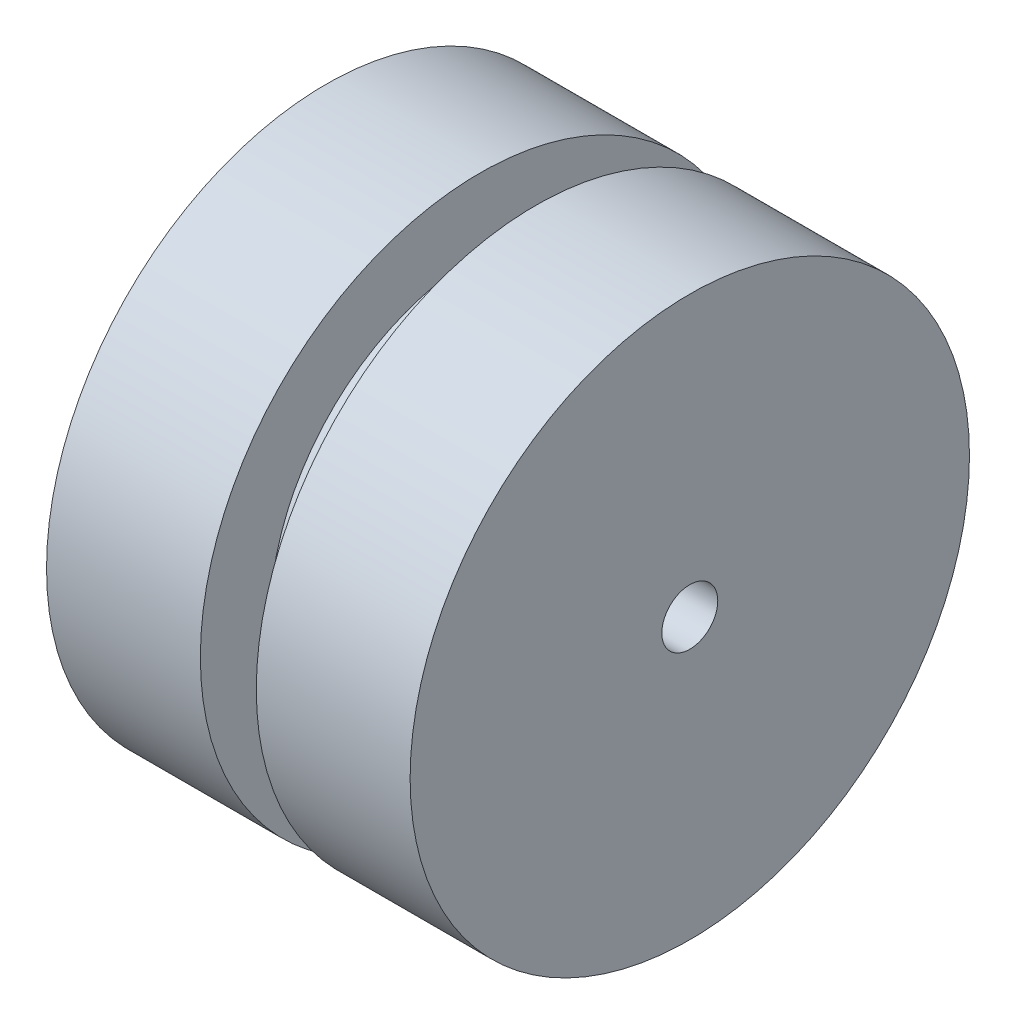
from build123d import *

# Parameters (mm, degrees)
SKETCH2_R      = 2
EXTRUDE1_DEPTH = 39.418745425


with BuildPart() as part:
    # Sketch1 → Revolve1 (revolve)
    with BuildSketch(Plane.XY, mode=Mode.PRIVATE) as revolve1_sk:
        Polygon((26, 0), (26, 20), (15, 20), (15, 15), (11, 15), (11, 20), (0, 20), (0, 0), align=None)
    revolve(revolve1_sk.sketch.rotate(Axis((0, 0, 0), (1, 0, 0)), 90), axis=Axis((0, 0, 0), (1, 0, 0)))

    # Sketch2 → Extrude1 (cut, through all)
    with BuildSketch(Plane(origin=(26, 0, 0), x_dir=(0, 0, -1), z_dir=(1, 0, 0))):
        Circle(SKETCH2_R)
    extrude(amount=-EXTRUDE1_DEPTH, mode=Mode.SUBTRACT)


solid = part.part
